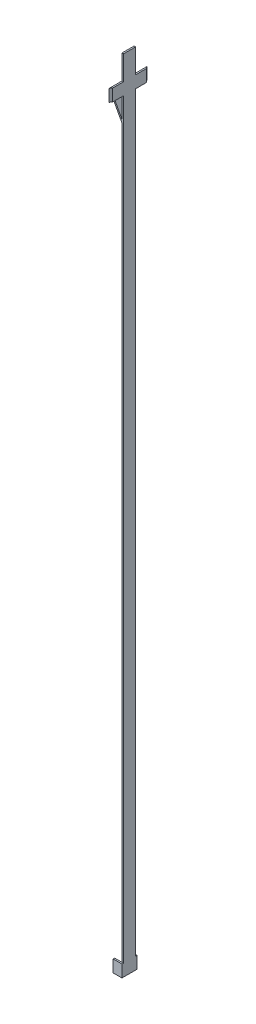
from build123d import *

# Parameters (mm, degrees)
BOSS_EXTRUDE2_DEPTH     = 2.5
SKETCH2_5_W             = 3
SKETCH2_5_H             = 5
SKETCH2_5_W_2           = 0.61
BOSS_EXTRUDE3_DEPTH     = 3.11
CUT_EXTRUDE1_REACH      = 327.052
SKETCH3_W               = 3
SKETCH3_H               = 5
SKETCH5_W               = 0.61
SKETCH5_H               = 5
BOSS_EXTRUDE4_DEPTH     = 10.61
CUT_EXTRUDE2_DEPTH      = 331.20723532
CUT_EXTRUDE2_DEPTH_BACK = 331.20723532
SKETCH1_OUTSIDE_W       = 73.68
SKETCH1_OUTSIDE_H       = 89.366
SKETCH1_OUTSIDE_R       = 12


with BuildPart() as part:
    # Sketch2 → Boss-Extrude2 (new, symmetric)
    with BuildSketch(Plane.XY):
        Polygon((0, -25), (0, -325), (0.61, -325), (0.61, 0), (0, 0), (0, -15), (-4.924038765, -15.868240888), align=None)
        Polygon((0, -15.619410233), (0, -23.714756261), (-3.986179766, -16.322281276), align=None, mode=Mode.SUBTRACT)
    extrude(amount=BOSS_EXTRUDE2_DEPTH, both=True)

    # Sketch2_5 → Boss-Extrude3 (add, symmetric)
    with BuildSketch(Plane.XY):
        with Locations((-1.5, -327.5)):
            Rectangle(SKETCH2_5_W, SKETCH2_5_H)
        with Locations((0.305, -327.5)):
            Rectangle(SKETCH2_5_W_2, SKETCH2_5_H)
    extrude(amount=BOSS_EXTRUDE3_DEPTH, both=True)

    # Sketch3 → Cut-Extrude1 (cut, up to next)
    with BuildSketch(Plane(origin=(0, -325, 0), x_dir=(1, 0, 0), z_dir=(0, 1, 0)), mode=Mode.PRIVATE) as cut_extrude1_sk1:
        with Locations((-1.5, 0)):
            Rectangle(SKETCH3_W, SKETCH3_H)
    cut_extrude1_tool1 = extrude(cut_extrude1_sk1.sketch, amount=-CUT_EXTRUDE1_REACH, mode=Mode.PRIVATE) & part.part
    add(cut_extrude1_tool1.solids().sort_by_distance((-1.5, -325, 0))[0], mode=Mode.SUBTRACT)

    # Sketch5 → Boss-Extrude4 (add, symmetric)
    with BuildSketch(Plane.XY):
        with Locations((0.305, -12.5)):
            Rectangle(SKETCH5_W, SKETCH5_H)
    extrude(amount=BOSS_EXTRUDE4_DEPTH, both=True)

    # Sketch1 outside → Cut-Extrude2 (cut, two sides: drawn at the far end of the back side and taken through both)
    with BuildSketch(Plane(origin=(0, 0, 0), x_dir=(1, 0, 0), z_dir=(0, 1, 0)).offset(-CUT_EXTRUDE2_DEPTH_BACK)):
        with Locations((-2.157, 0)):
            Rectangle(SKETCH1_OUTSIDE_W, SKETCH1_OUTSIDE_H)
        with Locations((-9.17, 0)):
            Circle(SKETCH1_OUTSIDE_R, mode=Mode.SUBTRACT)
    extrude(amount=CUT_EXTRUDE2_DEPTH + CUT_EXTRUDE2_DEPTH_BACK, mode=Mode.SUBTRACT)


solid = part.part
